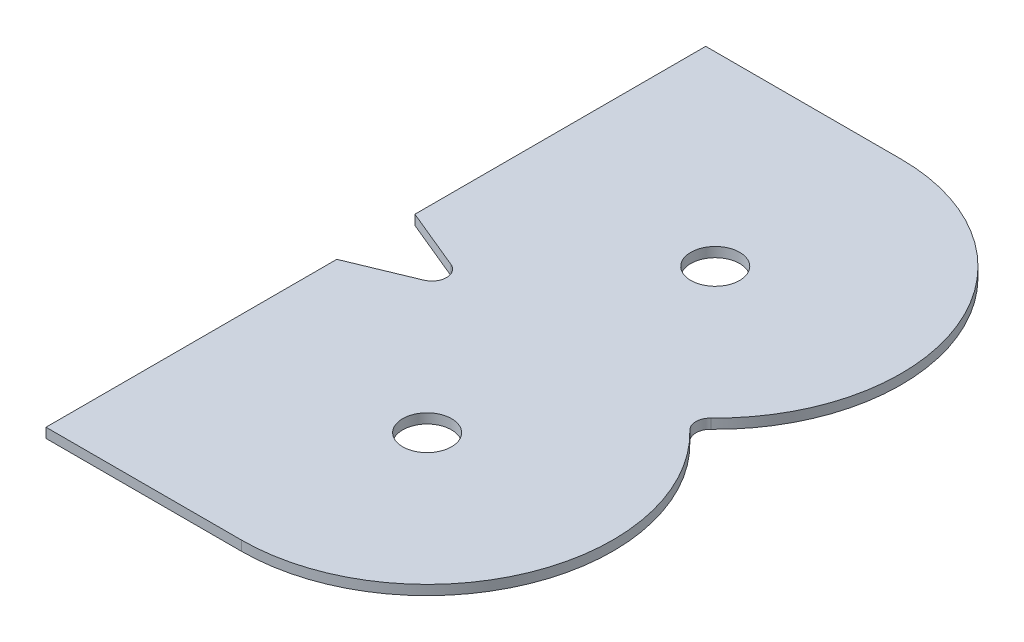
ISO-10303-21;
HEADER;
FILE_DESCRIPTION(('STEP AP214'),'2;1');
FILE_NAME('part.step','',(''),(''),'','','');
FILE_SCHEMA(('AUTOMOTIVE_DESIGN { 1 0 10303 214 1 1 1 1 }'));
ENDSEC;
DATA;
#1=APPLICATION_CONTEXT('core data for automotive mechanical design processes');
#2=APPLICATION_PROTOCOL_DEFINITION('international standard','automotive_design',2000,#1);
#3=PRODUCT_CONTEXT('',#1,'mechanical');
#4=PRODUCT('Part','Part','',(#3));
#5=PRODUCT_RELATED_PRODUCT_CATEGORY('part','',(#4));
#6=PRODUCT_DEFINITION_FORMATION('','',#4);
#7=PRODUCT_DEFINITION_CONTEXT('part definition',#1,'design');
#8=PRODUCT_DEFINITION('design','',#6,#7);
#9=PRODUCT_DEFINITION_SHAPE('','',#8);
#10=(LENGTH_UNIT() NAMED_UNIT(*) SI_UNIT(.MILLI.,.METRE.));
#11=(NAMED_UNIT(*) PLANE_ANGLE_UNIT() SI_UNIT($,.RADIAN.));
#12=(NAMED_UNIT(*) SI_UNIT($,.STERADIAN.) SOLID_ANGLE_UNIT());
#13=UNCERTAINTY_MEASURE_WITH_UNIT(LENGTH_MEASURE(1.E-05),#10,'distance_accuracy_value','');
#14=(GEOMETRIC_REPRESENTATION_CONTEXT(3) GLOBAL_UNCERTAINTY_ASSIGNED_CONTEXT((#13)) GLOBAL_UNIT_ASSIGNED_CONTEXT((#10,
#11,#12)) REPRESENTATION_CONTEXT('',''));
#15=CARTESIAN_POINT('',(0.,0.,0.));
#16=DIRECTION('',(0.,0.,1.));
#17=DIRECTION('',(1.,0.,0.));
#18=AXIS2_PLACEMENT_3D('',#15,#16,#17);
#19=CARTESIAN_POINT('',(0.,2.,0.));
#20=DIRECTION('',(0.,1.,0.));
#21=DIRECTION('',(0.,0.,1.));
#22=AXIS2_PLACEMENT_3D('',#19,#20,#21);
#23=PLANE('',#22);
#24=CARTESIAN_POINT('',(0.,2.,-29.5));
#25=DIRECTION('',(0.,1.,0.));
#26=DIRECTION('',(0.,0.,1.));
#27=AXIS2_PLACEMENT_3D('',#24,#25,#26);
#28=CIRCLE('',#27,5.);
#29=CARTESIAN_POINT('',(0.,2.,-24.5));
#30=VERTEX_POINT('',#29);
#31=EDGE_CURVE('E160',#30,#30,#28,.F.);
#32=ORIENTED_EDGE('',*,*,#31,.T.);
#33=EDGE_LOOP('',(#32));
#34=FACE_BOUND('',#33,.T.);
#35=CARTESIAN_POINT('',(0.,2.,29.5));
#36=DIRECTION('',(0.,1.,0.));
#37=DIRECTION('',(0.,0.,1.));
#38=AXIS2_PLACEMENT_3D('',#35,#36,#37);
#39=CIRCLE('',#38,5.);
#40=CARTESIAN_POINT('',(0.,2.,34.5));
#41=VERTEX_POINT('',#40);
#42=EDGE_CURVE('E163',#41,#41,#39,.F.);
#43=ORIENTED_EDGE('',*,*,#42,.T.);
#44=EDGE_LOOP('',(#43));
#45=FACE_BOUND('',#44,.T.);
#46=DIRECTION('',(1.,0.,0.));
#47=VECTOR('',#46,1.);
#48=CARTESIAN_POINT('',(-40.,2.,67.55));
#49=LINE('',#48,#47);
#50=CARTESIAN_POINT('',(0.,2.,67.55));
#51=VERTEX_POINT('',#50);
#52=CARTESIAN_POINT('',(-40.,2.,67.55));
#53=VERTEX_POINT('',#52);
#54=EDGE_CURVE('E96',#51,#53,#49,.F.);
#55=ORIENTED_EDGE('',*,*,#54,.F.);
#56=CARTESIAN_POINT('',(0.,2.,29.5));
#57=DIRECTION('',(0.,1.,0.));
#58=DIRECTION('',(0.,0.,1.));
#59=AXIS2_PLACEMENT_3D('',#56,#57,#58);
#60=CIRCLE('',#59,38.05);
#61=CARTESIAN_POINT('',(26.4594614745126,2.,2.15590742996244));
#62=VERTEX_POINT('',#61);
#63=EDGE_CURVE('E19',#62,#51,#60,.F.);
#64=ORIENTED_EDGE('',*,*,#63,.F.);
#65=CARTESIAN_POINT('',(28.54562138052,2.,0.));
#66=DIRECTION('',(0.,1.,0.));
#67=DIRECTION('',(0.,0.,1.));
#68=AXIS2_PLACEMENT_3D('',#65,#66,#67);
#69=CIRCLE('',#68,3.);
#70=CARTESIAN_POINT('',(26.4594614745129,2.,-2.15590742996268));
#71=VERTEX_POINT('',#70);
#72=EDGE_CURVE('E93',#62,#71,#69,.F.);
#73=ORIENTED_EDGE('',*,*,#72,.T.);
#74=CARTESIAN_POINT('',(0.,2.,-29.5));
#75=DIRECTION('',(0.,1.,0.));
#76=DIRECTION('',(0.,0.,1.));
#77=AXIS2_PLACEMENT_3D('',#74,#75,#76);
#78=CIRCLE('',#77,38.05);
#79=CARTESIAN_POINT('',(0.,2.,-67.55));
#80=VERTEX_POINT('',#79);
#81=EDGE_CURVE('E107',#80,#71,#78,.F.);
#82=ORIENTED_EDGE('',*,*,#81,.F.);
#83=DIRECTION('',(-1.,0.,0.));
#84=VECTOR('',#83,1.);
#85=CARTESIAN_POINT('',(0.,2.,-67.55));
#86=LINE('',#85,#84);
#87=CARTESIAN_POINT('',(-40.,2.,-67.55));
#88=VERTEX_POINT('',#87);
#89=EDGE_CURVE('E141',#88,#80,#86,.F.);
#90=ORIENTED_EDGE('',*,*,#89,.F.);
#91=DIRECTION('',(0.,0.,1.));
#92=VECTOR('',#91,1.);
#93=CARTESIAN_POINT('',(-40.,2.,-67.55));
#94=LINE('',#93,#92);
#95=CARTESIAN_POINT('',(-40.,2.,-8.));
#96=VERTEX_POINT('',#95);
#97=EDGE_CURVE('E136',#96,#88,#94,.F.);
#98=ORIENTED_EDGE('',*,*,#97,.F.);
#99=DIRECTION('',(0.923879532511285,0.,0.382683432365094));
#100=VECTOR('',#99,1.);
#101=CARTESIAN_POINT('',(-40.,2.,-8.));
#102=LINE('',#101,#100);
#103=CARTESIAN_POINT('',(-27.3776189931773,2.,-2.77163859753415));
#104=VERTEX_POINT('',#103);
#105=EDGE_CURVE('E130',#104,#96,#102,.F.);
#106=ORIENTED_EDGE('',*,*,#105,.F.);
#107=CARTESIAN_POINT('',(-28.52566929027,2.,0.));
#108=DIRECTION('',(0.,1.,0.));
#109=DIRECTION('',(0.,0.,1.));
#110=AXIS2_PLACEMENT_3D('',#107,#108,#109);
#111=CIRCLE('',#110,3.);
#112=CARTESIAN_POINT('',(-27.3776189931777,2.,2.77163859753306));
#113=VERTEX_POINT('',#112);
#114=EDGE_CURVE('E127',#104,#113,#111,.F.);
#115=ORIENTED_EDGE('',*,*,#114,.T.);
#116=DIRECTION('',(-0.923879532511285,0.,0.382683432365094));
#117=VECTOR('',#116,1.);
#118=CARTESIAN_POINT('',(-27.37761899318,2.,2.771638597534));
#119=LINE('',#118,#117);
#120=CARTESIAN_POINT('',(-40.0000000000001,2.,7.99999999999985));
#121=VERTEX_POINT('',#120);
#122=EDGE_CURVE('E125',#121,#113,#119,.F.);
#123=ORIENTED_EDGE('',*,*,#122,.F.);
#124=DIRECTION('',(0.,0.,1.));
#125=VECTOR('',#124,1.);
#126=CARTESIAN_POINT('',(-40.,2.,8.));
#127=LINE('',#126,#125);
#128=EDGE_CURVE('E115',#53,#121,#127,.F.);
#129=ORIENTED_EDGE('',*,*,#128,.F.);
#130=EDGE_LOOP('',(#55,#64,#73,#82,#90,#98,#106,#115,#123,#129));
#131=FACE_BOUND('',#130,.T.);
#132=ADVANCED_FACE('F16',(#34,#45,#131),#23,.T.);
#133=CARTESIAN_POINT('',(0.,0.,29.5));
#134=DIRECTION('',(0.,1.,0.));
#135=DIRECTION('',(0.,0.,1.));
#136=AXIS2_PLACEMENT_3D('',#133,#134,#135);
#137=CYLINDRICAL_SURFACE('',#136,38.05);
#138=DIRECTION('',(0.,1.,0.));
#139=VECTOR('',#138,1.);
#140=CARTESIAN_POINT('',(0.,0.,67.55));
#141=LINE('',#140,#139);
#142=CARTESIAN_POINT('',(0.,0.,67.55));
#143=VERTEX_POINT('',#142);
#144=EDGE_CURVE('E122',#143,#51,#141,.T.);
#145=ORIENTED_EDGE('',*,*,#144,.F.);
#146=CARTESIAN_POINT('',(0.,0.,29.5));
#147=DIRECTION('',(0.,1.,0.));
#148=DIRECTION('',(0.,0.,1.));
#149=AXIS2_PLACEMENT_3D('',#146,#147,#148);
#150=CIRCLE('',#149,38.05);
#151=CARTESIAN_POINT('',(26.4594614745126,0.,2.15590742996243));
#152=VERTEX_POINT('',#151);
#153=EDGE_CURVE('E110',#143,#152,#150,.T.);
#154=ORIENTED_EDGE('',*,*,#153,.T.);
#155=DIRECTION('',(0.,1.,0.));
#156=VECTOR('',#155,1.);
#157=CARTESIAN_POINT('',(26.4594614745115,0.,2.1559074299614));
#158=LINE('',#157,#156);
#159=EDGE_CURVE('E101',#152,#62,#158,.T.);
#160=ORIENTED_EDGE('',*,*,#159,.T.);
#161=ORIENTED_EDGE('',*,*,#63,.T.);
#162=EDGE_LOOP('',(#145,#154,#160,#161));
#163=FACE_BOUND('',#162,.T.);
#164=ADVANCED_FACE('F109',(#163),#137,.T.);
#165=CARTESIAN_POINT('',(28.54562138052,0.,0.));
#166=DIRECTION('',(0.,1.,0.));
#167=DIRECTION('',(0.,0.,1.));
#168=AXIS2_PLACEMENT_3D('',#165,#166,#167);
#169=CYLINDRICAL_SURFACE('',#168,3.);
#170=ORIENTED_EDGE('',*,*,#72,.F.);
#171=ORIENTED_EDGE('',*,*,#159,.F.);
#172=CARTESIAN_POINT('',(28.54562138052,0.,0.));
#173=DIRECTION('',(0.,1.,0.));
#174=DIRECTION('',(0.,0.,1.));
#175=AXIS2_PLACEMENT_3D('',#172,#173,#174);
#176=CIRCLE('',#175,3.);
#177=CARTESIAN_POINT('',(26.4594614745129,0.,-2.15590742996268));
#178=VERTEX_POINT('',#177);
#179=EDGE_CURVE('E157',#152,#178,#176,.F.);
#180=ORIENTED_EDGE('',*,*,#179,.T.);
#181=DIRECTION('',(0.,1.,0.));
#182=VECTOR('',#181,1.);
#183=CARTESIAN_POINT('',(26.459461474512,0.,-2.1559074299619));
#184=LINE('',#183,#182);
#185=EDGE_CURVE('E106',#71,#178,#184,.F.);
#186=ORIENTED_EDGE('',*,*,#185,.F.);
#187=EDGE_LOOP('',(#170,#171,#180,#186));
#188=FACE_BOUND('',#187,.T.);
#189=ADVANCED_FACE('F103',(#188),#169,.F.);
#190=CARTESIAN_POINT('',(0.,0.,-29.5));
#191=DIRECTION('',(0.,1.,0.));
#192=DIRECTION('',(0.,0.,1.));
#193=AXIS2_PLACEMENT_3D('',#190,#191,#192);
#194=CYLINDRICAL_SURFACE('',#193,38.05);
#195=ORIENTED_EDGE('',*,*,#185,.T.);
#196=CARTESIAN_POINT('',(0.,0.,-29.5));
#197=DIRECTION('',(0.,1.,0.));
#198=DIRECTION('',(0.,0.,1.));
#199=AXIS2_PLACEMENT_3D('',#196,#197,#198);
#200=CIRCLE('',#199,38.05);
#201=CARTESIAN_POINT('',(0.,0.,-67.55));
#202=VERTEX_POINT('',#201);
#203=EDGE_CURVE('E153',#178,#202,#200,.T.);
#204=ORIENTED_EDGE('',*,*,#203,.T.);
#205=DIRECTION('',(0.,1.,0.));
#206=VECTOR('',#205,1.);
#207=CARTESIAN_POINT('',(0.,0.,-67.55));
#208=LINE('',#207,#206);
#209=EDGE_CURVE('E138',#80,#202,#208,.F.);
#210=ORIENTED_EDGE('',*,*,#209,.F.);
#211=ORIENTED_EDGE('',*,*,#81,.T.);
#212=EDGE_LOOP('',(#195,#204,#210,#211));
#213=FACE_BOUND('',#212,.T.);
#214=ADVANCED_FACE('F172',(#213),#194,.T.);
#215=CARTESIAN_POINT('',(0.,0.,-67.55));
#216=DIRECTION('',(0.,0.,-1.));
#217=DIRECTION('',(-1.,0.,0.));
#218=AXIS2_PLACEMENT_3D('',#215,#216,#217);
#219=PLANE('',#218);
#220=ORIENTED_EDGE('',*,*,#209,.T.);
#221=DIRECTION('',(1.,0.,0.));
#222=VECTOR('',#221,1.);
#223=CARTESIAN_POINT('',(0.,0.,-67.55));
#224=LINE('',#223,#222);
#225=CARTESIAN_POINT('',(-40.,0.,-67.55));
#226=VERTEX_POINT('',#225);
#227=EDGE_CURVE('E156',#202,#226,#224,.F.);
#228=ORIENTED_EDGE('',*,*,#227,.T.);
#229=DIRECTION('',(0.,1.,0.));
#230=VECTOR('',#229,1.);
#231=CARTESIAN_POINT('',(-40.,0.,-67.55));
#232=LINE('',#231,#230);
#233=EDGE_CURVE('E133',#88,#226,#232,.F.);
#234=ORIENTED_EDGE('',*,*,#233,.F.);
#235=ORIENTED_EDGE('',*,*,#89,.T.);
#236=EDGE_LOOP('',(#220,#228,#234,#235));
#237=FACE_BOUND('',#236,.T.);
#238=ADVANCED_FACE('F214',(#237),#219,.T.);
#239=CARTESIAN_POINT('',(-40.,0.,-67.55));
#240=DIRECTION('',(-1.,0.,0.));
#241=DIRECTION('',(0.,0.,1.));
#242=AXIS2_PLACEMENT_3D('',#239,#240,#241);
#243=PLANE('',#242);
#244=ORIENTED_EDGE('',*,*,#233,.T.);
#245=DIRECTION('',(0.,0.,1.));
#246=VECTOR('',#245,1.);
#247=CARTESIAN_POINT('',(-40.,0.,0.));
#248=LINE('',#247,#246);
#249=CARTESIAN_POINT('',(-40.,0.,-8.));
#250=VERTEX_POINT('',#249);
#251=EDGE_CURVE('E181',#226,#250,#248,.T.);
#252=ORIENTED_EDGE('',*,*,#251,.T.);
#253=DIRECTION('',(0.,1.,0.));
#254=VECTOR('',#253,1.);
#255=CARTESIAN_POINT('',(-40.,0.,-8.));
#256=LINE('',#255,#254);
#257=EDGE_CURVE('E132',#96,#250,#256,.F.);
#258=ORIENTED_EDGE('',*,*,#257,.F.);
#259=ORIENTED_EDGE('',*,*,#97,.T.);
#260=EDGE_LOOP('',(#244,#252,#258,#259));
#261=FACE_BOUND('',#260,.T.);
#262=ADVANCED_FACE('F220',(#261),#243,.T.);
#263=CARTESIAN_POINT('',(-40.,0.,-8.));
#264=DIRECTION('',(-0.382683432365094,0.,0.923879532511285));
#265=DIRECTION('',(0.923879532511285,0.,0.382683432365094));
#266=AXIS2_PLACEMENT_3D('',#263,#264,#265);
#267=PLANE('',#266);
#268=ORIENTED_EDGE('',*,*,#257,.T.);
#269=DIRECTION('',(0.923879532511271,0.,0.382683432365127));
#270=VECTOR('',#269,1.);
#271=CARTESIAN_POINT('',(-40.,0.,-8.));
#272=LINE('',#271,#270);
#273=CARTESIAN_POINT('',(-27.3776189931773,0.,-2.77163859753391));
#274=VERTEX_POINT('',#273);
#275=EDGE_CURVE('E152',#250,#274,#272,.T.);
#276=ORIENTED_EDGE('',*,*,#275,.T.);
#277=DIRECTION('',(0.,1.,0.));
#278=VECTOR('',#277,1.);
#279=CARTESIAN_POINT('',(-27.3776189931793,0.,-2.77163859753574));
#280=LINE('',#279,#278);
#281=EDGE_CURVE('E168',#274,#104,#280,.T.);
#282=ORIENTED_EDGE('',*,*,#281,.T.);
#283=ORIENTED_EDGE('',*,*,#105,.T.);
#284=EDGE_LOOP('',(#268,#276,#282,#283));
#285=FACE_BOUND('',#284,.T.);
#286=ADVANCED_FACE('F223',(#285),#267,.T.);
#287=CARTESIAN_POINT('',(-28.52566929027,0.,0.));
#288=DIRECTION('',(0.,1.,0.));
#289=DIRECTION('',(0.,0.,1.));
#290=AXIS2_PLACEMENT_3D('',#287,#288,#289);
#291=CYLINDRICAL_SURFACE('',#290,3.);
#292=ORIENTED_EDGE('',*,*,#114,.F.);
#293=ORIENTED_EDGE('',*,*,#281,.F.);
#294=CARTESIAN_POINT('',(-28.52566929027,0.,0.));
#295=DIRECTION('',(0.,1.,0.));
#296=DIRECTION('',(0.,0.,1.));
#297=AXIS2_PLACEMENT_3D('',#294,#295,#296);
#298=CIRCLE('',#297,3.);
#299=CARTESIAN_POINT('',(-27.3776189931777,0.,2.77163859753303));
#300=VERTEX_POINT('',#299);
#301=EDGE_CURVE('E148',#274,#300,#298,.F.);
#302=ORIENTED_EDGE('',*,*,#301,.T.);
#303=DIRECTION('',(0.,1.,0.));
#304=VECTOR('',#303,1.);
#305=CARTESIAN_POINT('',(-27.37761899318,0.,2.771638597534));
#306=LINE('',#305,#304);
#307=EDGE_CURVE('E118',#113,#300,#306,.F.);
#308=ORIENTED_EDGE('',*,*,#307,.F.);
#309=EDGE_LOOP('',(#292,#293,#302,#308));
#310=FACE_BOUND('',#309,.T.);
#311=ADVANCED_FACE('F242',(#310),#291,.F.);
#312=CARTESIAN_POINT('',(-27.37761899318,0.,2.771638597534));
#313=DIRECTION('',(-0.382683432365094,0.,-0.923879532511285));
#314=DIRECTION('',(-0.923879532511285,0.,0.382683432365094));
#315=AXIS2_PLACEMENT_3D('',#312,#313,#314);
#316=PLANE('',#315);
#317=ORIENTED_EDGE('',*,*,#307,.T.);
#318=DIRECTION('',(-0.923879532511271,0.,0.382683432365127));
#319=VECTOR('',#318,1.);
#320=CARTESIAN_POINT('',(-27.37761899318,0.,2.771638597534));
#321=LINE('',#320,#319);
#322=CARTESIAN_POINT('',(-40.,0.,8.));
#323=VERTEX_POINT('',#322);
#324=EDGE_CURVE('E151',#300,#323,#321,.T.);
#325=ORIENTED_EDGE('',*,*,#324,.T.);
#326=DIRECTION('',(0.,1.,0.));
#327=VECTOR('',#326,1.);
#328=CARTESIAN_POINT('',(-40.,0.,8.));
#329=LINE('',#328,#327);
#330=EDGE_CURVE('E117',#121,#323,#329,.F.);
#331=ORIENTED_EDGE('',*,*,#330,.F.);
#332=ORIENTED_EDGE('',*,*,#122,.T.);
#333=EDGE_LOOP('',(#317,#325,#331,#332));
#334=FACE_BOUND('',#333,.T.);
#335=ADVANCED_FACE('F239',(#334),#316,.T.);
#336=CARTESIAN_POINT('',(-40.,0.,8.));
#337=DIRECTION('',(-1.,0.,0.));
#338=DIRECTION('',(0.,0.,1.));
#339=AXIS2_PLACEMENT_3D('',#336,#337,#338);
#340=PLANE('',#339);
#341=ORIENTED_EDGE('',*,*,#330,.T.);
#342=DIRECTION('',(0.,0.,1.));
#343=VECTOR('',#342,1.);
#344=CARTESIAN_POINT('',(-40.,0.,0.));
#345=LINE('',#344,#343);
#346=CARTESIAN_POINT('',(-40.,0.,67.55));
#347=VERTEX_POINT('',#346);
#348=EDGE_CURVE('E196',#323,#347,#345,.T.);
#349=ORIENTED_EDGE('',*,*,#348,.T.);
#350=DIRECTION('',(0.,1.,0.));
#351=VECTOR('',#350,1.);
#352=CARTESIAN_POINT('',(-40.,0.,67.55));
#353=LINE('',#352,#351);
#354=EDGE_CURVE('E34',#53,#347,#353,.F.);
#355=ORIENTED_EDGE('',*,*,#354,.F.);
#356=ORIENTED_EDGE('',*,*,#128,.T.);
#357=EDGE_LOOP('',(#341,#349,#355,#356));
#358=FACE_BOUND('',#357,.T.);
#359=ADVANCED_FACE('F235',(#358),#340,.T.);
#360=CARTESIAN_POINT('',(-40.,0.,67.55));
#361=DIRECTION('',(0.,0.,1.));
#362=DIRECTION('',(1.,0.,0.));
#363=AXIS2_PLACEMENT_3D('',#360,#361,#362);
#364=PLANE('',#363);
#365=ORIENTED_EDGE('',*,*,#354,.T.);
#366=DIRECTION('',(1.,0.,0.));
#367=VECTOR('',#366,1.);
#368=CARTESIAN_POINT('',(0.,0.,67.55));
#369=LINE('',#368,#367);
#370=EDGE_CURVE('E147',#347,#143,#369,.T.);
#371=ORIENTED_EDGE('',*,*,#370,.T.);
#372=ORIENTED_EDGE('',*,*,#144,.T.);
#373=ORIENTED_EDGE('',*,*,#54,.T.);
#374=EDGE_LOOP('',(#365,#371,#372,#373));
#375=FACE_BOUND('',#374,.T.);
#376=ADVANCED_FACE('F233',(#375),#364,.T.);
#377=CARTESIAN_POINT('',(0.,2.,29.5));
#378=DIRECTION('',(0.,1.,0.));
#379=DIRECTION('',(0.,0.,1.));
#380=AXIS2_PLACEMENT_3D('',#377,#378,#379);
#381=CYLINDRICAL_SURFACE('',#380,5.);
#382=ORIENTED_EDGE('',*,*,#42,.F.);
#383=EDGE_LOOP('',(#382));
#384=FACE_BOUND('',#383,.T.);
#385=CARTESIAN_POINT('',(0.,0.,29.5));
#386=DIRECTION('',(0.,1.,0.));
#387=DIRECTION('',(0.,0.,1.));
#388=AXIS2_PLACEMENT_3D('',#385,#386,#387);
#389=CIRCLE('',#388,5.);
#390=CARTESIAN_POINT('',(0.,0.,34.5));
#391=VERTEX_POINT('',#390);
#392=EDGE_CURVE('E25',#391,#391,#389,.F.);
#393=ORIENTED_EDGE('',*,*,#392,.T.);
#394=EDGE_LOOP('',(#393));
#395=FACE_BOUND('',#394,.T.);
#396=ADVANCED_FACE('F259',(#384,#395),#381,.F.);
#397=CARTESIAN_POINT('',(0.,2.,-29.5));
#398=DIRECTION('',(0.,1.,0.));
#399=DIRECTION('',(0.,0.,1.));
#400=AXIS2_PLACEMENT_3D('',#397,#398,#399);
#401=CYLINDRICAL_SURFACE('',#400,5.);
#402=ORIENTED_EDGE('',*,*,#31,.F.);
#403=EDGE_LOOP('',(#402));
#404=FACE_BOUND('',#403,.T.);
#405=CARTESIAN_POINT('',(0.,0.,-29.5));
#406=DIRECTION('',(0.,1.,0.));
#407=DIRECTION('',(0.,0.,1.));
#408=AXIS2_PLACEMENT_3D('',#405,#406,#407);
#409=CIRCLE('',#408,5.);
#410=CARTESIAN_POINT('',(0.,0.,-24.5));
#411=VERTEX_POINT('',#410);
#412=EDGE_CURVE('E11',#411,#411,#409,.F.);
#413=ORIENTED_EDGE('',*,*,#412,.T.);
#414=EDGE_LOOP('',(#413));
#415=FACE_BOUND('',#414,.T.);
#416=ADVANCED_FACE('F253',(#404,#415),#401,.F.);
#417=CARTESIAN_POINT('',(0.,0.,0.));
#418=DIRECTION('',(0.,1.,0.));
#419=DIRECTION('',(0.,0.,1.));
#420=AXIS2_PLACEMENT_3D('',#417,#418,#419);
#421=PLANE('',#420);
#422=ORIENTED_EDGE('',*,*,#412,.F.);
#423=EDGE_LOOP('',(#422));
#424=FACE_BOUND('',#423,.T.);
#425=ORIENTED_EDGE('',*,*,#392,.F.);
#426=EDGE_LOOP('',(#425));
#427=FACE_BOUND('',#426,.T.);
#428=ORIENTED_EDGE('',*,*,#348,.F.);
#429=ORIENTED_EDGE('',*,*,#324,.F.);
#430=ORIENTED_EDGE('',*,*,#301,.F.);
#431=ORIENTED_EDGE('',*,*,#275,.F.);
#432=ORIENTED_EDGE('',*,*,#251,.F.);
#433=ORIENTED_EDGE('',*,*,#227,.F.);
#434=ORIENTED_EDGE('',*,*,#203,.F.);
#435=ORIENTED_EDGE('',*,*,#179,.F.);
#436=ORIENTED_EDGE('',*,*,#153,.F.);
#437=ORIENTED_EDGE('',*,*,#370,.F.);
#438=EDGE_LOOP('',(#428,#429,#430,#431,#432,#433,#434,#435,#436,#437));
#439=FACE_BOUND('',#438,.T.);
#440=ADVANCED_FACE('F176',(#424,#427,#439),#421,.F.);
#441=CLOSED_SHELL('',(#132,#164,#189,#214,#238,#262,#286,#311,#335,#359,#376,#396,#416,#440));
#442=MANIFOLD_SOLID_BREP('B1',#441);
#443=ADVANCED_BREP_SHAPE_REPRESENTATION('',(#18,#442),#14);
#444=SHAPE_DEFINITION_REPRESENTATION(#9,#443);
ENDSEC;
END-ISO-10303-21;
